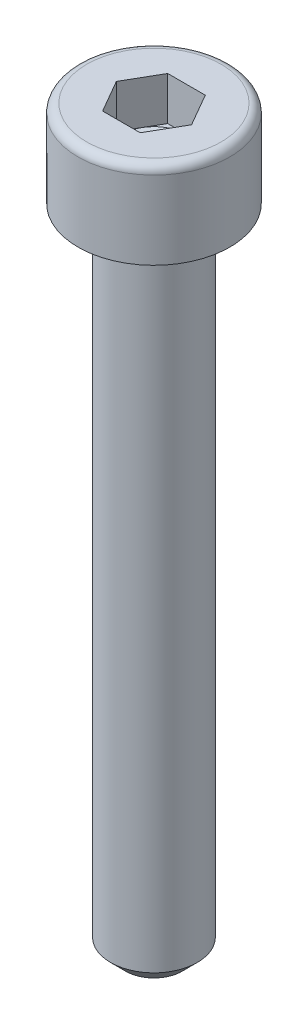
ISO-10303-21;
HEADER;
FILE_DESCRIPTION(('STEP AP214'),'2;1');
FILE_NAME('part.step','',(''),(''),'','','');
FILE_SCHEMA(('AUTOMOTIVE_DESIGN { 1 0 10303 214 1 1 1 1 }'));
ENDSEC;
DATA;
#1=APPLICATION_CONTEXT('core data for automotive mechanical design processes');
#2=APPLICATION_PROTOCOL_DEFINITION('international standard','automotive_design',2000,#1);
#3=PRODUCT_CONTEXT('',#1,'mechanical');
#4=PRODUCT('Part','Part','',(#3));
#5=PRODUCT_RELATED_PRODUCT_CATEGORY('part','',(#4));
#6=PRODUCT_DEFINITION_FORMATION('','',#4);
#7=PRODUCT_DEFINITION_CONTEXT('part definition',#1,'design');
#8=PRODUCT_DEFINITION('design','',#6,#7);
#9=PRODUCT_DEFINITION_SHAPE('','',#8);
#10=(LENGTH_UNIT() NAMED_UNIT(*) SI_UNIT(.MILLI.,.METRE.));
#11=(NAMED_UNIT(*) PLANE_ANGLE_UNIT() SI_UNIT($,.RADIAN.));
#12=(NAMED_UNIT(*) SI_UNIT($,.STERADIAN.) SOLID_ANGLE_UNIT());
#13=UNCERTAINTY_MEASURE_WITH_UNIT(LENGTH_MEASURE(1.E-05),#10,'distance_accuracy_value','');
#14=(GEOMETRIC_REPRESENTATION_CONTEXT(3) GLOBAL_UNCERTAINTY_ASSIGNED_CONTEXT((#13)) GLOBAL_UNIT_ASSIGNED_CONTEXT((#10,
#11,#12)) REPRESENTATION_CONTEXT('',''));
#15=CARTESIAN_POINT('',(0.,0.,0.));
#16=DIRECTION('',(0.,0.,1.));
#17=DIRECTION('',(1.,0.,0.));
#18=AXIS2_PLACEMENT_3D('',#15,#16,#17);
#19=CARTESIAN_POINT('',(1.5,4.,0.));
#20=DIRECTION('',(0.,-1.,0.));
#21=DIRECTION('',(1.,0.,0.));
#22=AXIS2_PLACEMENT_3D('',#19,#20,#21);
#23=PLANE('',#22);
#24=CARTESIAN_POINT('',(0.,4.,0.));
#25=DIRECTION('',(0.,1.,0.));
#26=DIRECTION('',(-1.,0.,0.));
#27=AXIS2_PLACEMENT_3D('',#24,#25,#26);
#28=CIRCLE('',#27,3.1);
#29=CARTESIAN_POINT('',(-3.1,4.,0.));
#30=VERTEX_POINT('',#29);
#31=EDGE_CURVE('E140',#30,#30,#28,.T.);
#32=ORIENTED_EDGE('',*,*,#31,.T.);
#33=EDGE_LOOP('',(#32));
#34=FACE_BOUND('',#33,.T.);
#35=DIRECTION('',(0.499999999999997,0.,0.86602540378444));
#36=VECTOR('',#35,1.);
#37=CARTESIAN_POINT('',(0.866025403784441,4.,-1.5));
#38=LINE('',#37,#36);
#39=CARTESIAN_POINT('',(0.866025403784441,4.,-1.5));
#40=VERTEX_POINT('',#39);
#41=CARTESIAN_POINT('',(1.73205080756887,4.,0.));
#42=VERTEX_POINT('',#41);
#43=EDGE_CURVE('E372',#40,#42,#38,.T.);
#44=ORIENTED_EDGE('',*,*,#43,.T.);
#45=DIRECTION('',(-0.499999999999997,0.,0.86602540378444));
#46=VECTOR('',#45,1.);
#47=CARTESIAN_POINT('',(0.866025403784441,4.,1.5));
#48=LINE('',#47,#46);
#49=CARTESIAN_POINT('',(0.866025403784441,4.,1.5));
#50=VERTEX_POINT('',#49);
#51=EDGE_CURVE('E375',#42,#50,#48,.T.);
#52=ORIENTED_EDGE('',*,*,#51,.T.);
#53=DIRECTION('',(-1.,0.,0.));
#54=VECTOR('',#53,1.);
#55=CARTESIAN_POINT('',(0.866025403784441,4.,1.5));
#56=LINE('',#55,#54);
#57=CARTESIAN_POINT('',(-0.866025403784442,4.,1.5));
#58=VERTEX_POINT('',#57);
#59=EDGE_CURVE('E378',#50,#58,#56,.T.);
#60=ORIENTED_EDGE('',*,*,#59,.T.);
#61=DIRECTION('',(-0.499999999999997,0.,-0.86602540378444));
#62=VECTOR('',#61,1.);
#63=CARTESIAN_POINT('',(-0.866025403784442,4.,1.5));
#64=LINE('',#63,#62);
#65=CARTESIAN_POINT('',(-1.73205080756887,4.,0.));
#66=VERTEX_POINT('',#65);
#67=EDGE_CURVE('E117',#58,#66,#64,.T.);
#68=ORIENTED_EDGE('',*,*,#67,.T.);
#69=DIRECTION('',(0.499999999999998,0.,-0.86602540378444));
#70=VECTOR('',#69,1.);
#71=CARTESIAN_POINT('',(-0.866025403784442,4.,-1.5));
#72=LINE('',#71,#70);
#73=CARTESIAN_POINT('',(-0.866025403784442,4.,-1.5));
#74=VERTEX_POINT('',#73);
#75=EDGE_CURVE('E369',#66,#74,#72,.T.);
#76=ORIENTED_EDGE('',*,*,#75,.T.);
#77=DIRECTION('',(1.,0.,0.));
#78=VECTOR('',#77,1.);
#79=CARTESIAN_POINT('',(0.866025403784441,4.,-1.5));
#80=LINE('',#79,#78);
#81=EDGE_CURVE('E128',#74,#40,#80,.T.);
#82=ORIENTED_EDGE('',*,*,#81,.T.);
#83=EDGE_LOOP('',(#44,#52,#60,#68,#76,#82));
#84=FACE_BOUND('',#83,.T.);
#85=ADVANCED_FACE('F34',(#34,#84),#23,.F.);
#86=CARTESIAN_POINT('',(0.,-30.,0.));
#87=DIRECTION('',(0.,1.,0.));
#88=DIRECTION('',(0.,0.,1.));
#89=AXIS2_PLACEMENT_3D('',#86,#87,#88);
#90=CYLINDRICAL_SURFACE('',#89,2.);
#91=CARTESIAN_POINT('',(0.,-29.3,0.));
#92=DIRECTION('',(0.,1.,0.));
#93=DIRECTION('',(0.,0.,1.));
#94=AXIS2_PLACEMENT_3D('',#91,#92,#93);
#95=CIRCLE('',#94,2.);
#96=CARTESIAN_POINT('',(0.,-29.3,2.));
#97=VERTEX_POINT('',#96);
#98=EDGE_CURVE('E42',#97,#97,#95,.T.);
#99=ORIENTED_EDGE('',*,*,#98,.T.);
#100=EDGE_LOOP('',(#99));
#101=FACE_BOUND('',#100,.T.);
#102=CARTESIAN_POINT('',(0.,0.,0.));
#103=DIRECTION('',(0.,1.,0.));
#104=DIRECTION('',(0.,0.,1.));
#105=AXIS2_PLACEMENT_3D('',#102,#103,#104);
#106=CIRCLE('',#105,2.);
#107=CARTESIAN_POINT('',(0.,0.,2.));
#108=VERTEX_POINT('',#107);
#109=EDGE_CURVE('E150',#108,#108,#106,.T.);
#110=ORIENTED_EDGE('',*,*,#109,.F.);
#111=EDGE_LOOP('',(#110));
#112=FACE_BOUND('',#111,.T.);
#113=ADVANCED_FACE('F155',(#101,#112),#90,.T.);
#114=CARTESIAN_POINT('',(0.,-30.,0.));
#115=DIRECTION('',(0.,1.,0.));
#116=DIRECTION('',(0.,0.,1.));
#117=AXIS2_PLACEMENT_3D('',#114,#115,#116);
#118=PLANE('',#117);
#119=CARTESIAN_POINT('',(0.,-30.,0.));
#120=DIRECTION('',(0.,1.,0.));
#121=DIRECTION('',(0.,0.,1.));
#122=AXIS2_PLACEMENT_3D('',#119,#120,#121);
#123=CIRCLE('',#122,1.3);
#124=CARTESIAN_POINT('',(0.,-30.,1.29999999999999));
#125=VERTEX_POINT('',#124);
#126=EDGE_CURVE('E11',#125,#125,#123,.F.);
#127=ORIENTED_EDGE('',*,*,#126,.T.);
#128=EDGE_LOOP('',(#127));
#129=FACE_BOUND('',#128,.T.);
#130=ADVANCED_FACE('F160',(#129),#118,.F.);
#131=CARTESIAN_POINT('',(0.,-29.3,0.));
#132=DIRECTION('',(0.,1.,0.));
#133=DIRECTION('',(0.,0.,1.));
#134=AXIS2_PLACEMENT_3D('',#131,#132,#133);
#135=CONICAL_SURFACE('',#134,2.,0.785398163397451);
#136=CARTESIAN_POINT('',(0.,-30.,1.29999999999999));
#137=CARTESIAN_POINT('',(0.,-29.9927083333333,1.30729166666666));
#138=CARTESIAN_POINT('',(0.,-29.9854166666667,1.31458333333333));
#139=CARTESIAN_POINT('',(0.,-29.9708333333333,1.32916666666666));
#140=CARTESIAN_POINT('',(0.,-29.9635416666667,1.33645833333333));
#141=CARTESIAN_POINT('',(0.,-29.9489583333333,1.35104166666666));
#142=CARTESIAN_POINT('',(0.,-29.9416666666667,1.35833333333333));
#143=CARTESIAN_POINT('',(0.,-29.9270833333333,1.37291666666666));
#144=CARTESIAN_POINT('',(0.,-29.9197916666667,1.38020833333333));
#145=CARTESIAN_POINT('',(0.,-29.9052083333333,1.39479166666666));
#146=CARTESIAN_POINT('',(0.,-29.8979166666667,1.40208333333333));
#147=CARTESIAN_POINT('',(0.,-29.8833333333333,1.41666666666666));
#148=CARTESIAN_POINT('',(0.,-29.8760416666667,1.42395833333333));
#149=CARTESIAN_POINT('',(0.,-29.8614583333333,1.43854166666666));
#150=CARTESIAN_POINT('',(0.,-29.8541666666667,1.44583333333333));
#151=CARTESIAN_POINT('',(0.,-29.8395833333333,1.46041666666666));
#152=CARTESIAN_POINT('',(0.,-29.8322916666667,1.46770833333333));
#153=CARTESIAN_POINT('',(0.,-29.8177083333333,1.48229166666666));
#154=CARTESIAN_POINT('',(0.,-29.8104166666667,1.48958333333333));
#155=CARTESIAN_POINT('',(0.,-29.7958333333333,1.50416666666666));
#156=CARTESIAN_POINT('',(0.,-29.7885416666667,1.51145833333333));
#157=CARTESIAN_POINT('',(0.,-29.7739583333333,1.52604166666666));
#158=CARTESIAN_POINT('',(0.,-29.7666666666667,1.53333333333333));
#159=CARTESIAN_POINT('',(0.,-29.7520833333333,1.54791666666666));
#160=CARTESIAN_POINT('',(0.,-29.7447916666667,1.55520833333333));
#161=CARTESIAN_POINT('',(0.,-29.7302083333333,1.56979166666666));
#162=CARTESIAN_POINT('',(0.,-29.7229166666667,1.57708333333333));
#163=CARTESIAN_POINT('',(0.,-29.7083333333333,1.59166666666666));
#164=CARTESIAN_POINT('',(0.,-29.7010416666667,1.59895833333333));
#165=CARTESIAN_POINT('',(0.,-29.6864583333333,1.61354166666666));
#166=CARTESIAN_POINT('',(0.,-29.6791666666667,1.62083333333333));
#167=CARTESIAN_POINT('',(0.,-29.6645833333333,1.63541666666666));
#168=CARTESIAN_POINT('',(0.,-29.6572916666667,1.64270833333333));
#169=CARTESIAN_POINT('',(0.,-29.6427083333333,1.65729166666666));
#170=CARTESIAN_POINT('',(0.,-29.6354166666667,1.66458333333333));
#171=CARTESIAN_POINT('',(0.,-29.6208333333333,1.67916666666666));
#172=CARTESIAN_POINT('',(0.,-29.6135416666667,1.68645833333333));
#173=CARTESIAN_POINT('',(0.,-29.5989583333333,1.70104166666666));
#174=CARTESIAN_POINT('',(0.,-29.5916666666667,1.70833333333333));
#175=CARTESIAN_POINT('',(0.,-29.5770833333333,1.72291666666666));
#176=CARTESIAN_POINT('',(0.,-29.5697916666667,1.73020833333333));
#177=CARTESIAN_POINT('',(0.,-29.5552083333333,1.74479166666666));
#178=CARTESIAN_POINT('',(0.,-29.5479166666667,1.75208333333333));
#179=CARTESIAN_POINT('',(0.,-29.5333333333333,1.76666666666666));
#180=CARTESIAN_POINT('',(0.,-29.5260416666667,1.77395833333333));
#181=CARTESIAN_POINT('',(0.,-29.5114583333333,1.78854166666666));
#182=CARTESIAN_POINT('',(0.,-29.5041666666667,1.79583333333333));
#183=CARTESIAN_POINT('',(0.,-29.4895833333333,1.81041666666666));
#184=CARTESIAN_POINT('',(0.,-29.4822916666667,1.81770833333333));
#185=CARTESIAN_POINT('',(0.,-29.4677083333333,1.83229166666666));
#186=CARTESIAN_POINT('',(0.,-29.4604166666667,1.83958333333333));
#187=CARTESIAN_POINT('',(0.,-29.4458333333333,1.85416666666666));
#188=CARTESIAN_POINT('',(0.,-29.4385416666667,1.86145833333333));
#189=CARTESIAN_POINT('',(0.,-29.4239583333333,1.87604166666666));
#190=CARTESIAN_POINT('',(0.,-29.4166666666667,1.88333333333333));
#191=CARTESIAN_POINT('',(0.,-29.4020833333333,1.89791666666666));
#192=CARTESIAN_POINT('',(0.,-29.3947916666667,1.90520833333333));
#193=CARTESIAN_POINT('',(0.,-29.3802083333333,1.91979166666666));
#194=CARTESIAN_POINT('',(0.,-29.3729166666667,1.92708333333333));
#195=CARTESIAN_POINT('',(0.,-29.3583333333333,1.94166666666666));
#196=CARTESIAN_POINT('',(0.,-29.3510416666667,1.94895833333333));
#197=CARTESIAN_POINT('',(0.,-29.3364583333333,1.96354166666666));
#198=CARTESIAN_POINT('',(0.,-29.3291666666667,1.97083333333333));
#199=CARTESIAN_POINT('',(0.,-29.3145833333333,1.98541666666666));
#200=CARTESIAN_POINT('',(0.,-29.3072916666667,1.99270833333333));
#201=CARTESIAN_POINT('',(0.,-29.3,2.));
#202=B_SPLINE_CURVE_WITH_KNOTS('',3,(#136,#137,#138,#139,#140,#141,#142,#143,#144,#145,#146,
#147,#148,#149,#150,#151,#152,#153,#154,#155,#156,#157,#158,#159,#160,#161,#162,#163,#164,#165,
#166,#167,#168,#169,#170,#171,#172,#173,#174,#175,#176,#177,#178,#179,#180,#181,#182,#183,#184,
#185,#186,#187,#188,#189,#190,#191,#192,#193,#194,#195,#196,#197,#198,#199,#200,#201),
.UNSPECIFIED.,.F.,.F.,(4,2,2,2,2,2,2,2,2,2,2,2,2,2,2,2,2,2,2,2,2,2,2,2,2,2,2,2,2,2,2,2,4),(0.,
0.0309359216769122,0.0618718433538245,0.0928077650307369,0.123743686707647,0.154679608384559,
0.185615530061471,0.216551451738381,0.247487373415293,0.278423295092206,0.309359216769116,
0.340295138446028,0.37123106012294,0.40216698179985,0.433102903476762,0.464038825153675,
0.494974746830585,0.525910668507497,0.556846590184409,0.587782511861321,0.618718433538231,
0.649654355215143,0.680590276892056,0.711526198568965,0.742462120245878,0.77339804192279,
0.8043339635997,0.835269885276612,0.866205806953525,0.897141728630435,0.928077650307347,
0.959013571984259,0.989949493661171),.UNSPECIFIED.);
#203=EDGE_CURVE('BSEAM36',#125,#97,#202,.T.);
#204=ORIENTED_EDGE('',*,*,#126,.F.);
#205=ORIENTED_EDGE('',*,*,#98,.F.);
#206=ORIENTED_EDGE('',*,*,#203,.T.);
#207=ORIENTED_EDGE('',*,*,#203,.F.);
#208=EDGE_LOOP('',(#204,#206,#205,#207));
#209=FACE_BOUND('',#208,.T.);
#210=ADVANCED_FACE('F36',(#209),#135,.T.);
#211=CARTESIAN_POINT('',(0.,0.,0.));
#212=DIRECTION('',(0.,1.,0.));
#213=DIRECTION('',(-1.,0.,0.));
#214=AXIS2_PLACEMENT_3D('',#211,#212,#213);
#215=PLANE('',#214);
#216=ORIENTED_EDGE('',*,*,#109,.T.);
#217=EDGE_LOOP('',(#216));
#218=FACE_BOUND('',#217,.T.);
#219=CARTESIAN_POINT('',(0.,0.,0.));
#220=DIRECTION('',(0.,1.,0.));
#221=DIRECTION('',(-1.,0.,0.));
#222=AXIS2_PLACEMENT_3D('',#219,#220,#221);
#223=CIRCLE('',#222,3.5);
#224=CARTESIAN_POINT('',(-3.5,0.,0.));
#225=VERTEX_POINT('',#224);
#226=EDGE_CURVE('E147',#225,#225,#223,.T.);
#227=ORIENTED_EDGE('',*,*,#226,.F.);
#228=EDGE_LOOP('',(#227));
#229=FACE_BOUND('',#228,.T.);
#230=ADVANCED_FACE('F159',(#218,#229),#215,.F.);
#231=CARTESIAN_POINT('',(0.,4.,0.));
#232=DIRECTION('',(0.,1.,0.));
#233=DIRECTION('',(-1.,0.,0.));
#234=AXIS2_PLACEMENT_3D('',#231,#232,#233);
#235=CYLINDRICAL_SURFACE('',#234,3.5);
#236=CARTESIAN_POINT('',(0.,3.6,0.));
#237=DIRECTION('',(0.,1.,0.));
#238=DIRECTION('',(-1.,0.,0.));
#239=AXIS2_PLACEMENT_3D('',#236,#237,#238);
#240=CIRCLE('',#239,3.5);
#241=CARTESIAN_POINT('',(-3.5,3.6,0.));
#242=VERTEX_POINT('',#241);
#243=EDGE_CURVE('E144',#242,#242,#240,.T.);
#244=ORIENTED_EDGE('',*,*,#243,.F.);
#245=EDGE_LOOP('',(#244));
#246=FACE_BOUND('',#245,.T.);
#247=ORIENTED_EDGE('',*,*,#226,.T.);
#248=EDGE_LOOP('',(#247));
#249=FACE_BOUND('',#248,.T.);
#250=ADVANCED_FACE('F166',(#246,#249),#235,.T.);
#251=CARTESIAN_POINT('',(0.,3.6,0.));
#252=DIRECTION('',(0.,1.,0.));
#253=DIRECTION('',(-1.,0.,0.));
#254=AXIS2_PLACEMENT_3D('',#251,#252,#253);
#255=TOROIDAL_SURFACE('',#254,3.1,0.4);
#256=ORIENTED_EDGE('',*,*,#31,.F.);
#257=EDGE_LOOP('',(#256));
#258=FACE_BOUND('',#257,.T.);
#259=ORIENTED_EDGE('',*,*,#243,.T.);
#260=EDGE_LOOP('',(#259));
#261=FACE_BOUND('',#260,.T.);
#262=ADVANCED_FACE('F183',(#258,#261),#255,.T.);
#263=CARTESIAN_POINT('',(-0.866025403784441,2.,-1.5));
#264=DIRECTION('',(0.86602540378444,0.,0.499999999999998));
#265=DIRECTION('',(0.499999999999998,0.,-0.86602540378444));
#266=AXIS2_PLACEMENT_3D('',#263,#264,#265);
#267=PLANE('',#266);
#268=ORIENTED_EDGE('',*,*,#75,.F.);
#269=DIRECTION('',(0.,1.,0.));
#270=VECTOR('',#269,1.);
#271=CARTESIAN_POINT('',(-1.73205080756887,2.,0.));
#272=LINE('',#271,#270);
#273=CARTESIAN_POINT('',(-1.73205080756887,2.,0.));
#274=VERTEX_POINT('',#273);
#275=EDGE_CURVE('E364',#274,#66,#272,.T.);
#276=ORIENTED_EDGE('',*,*,#275,.F.);
#277=DIRECTION('',(0.499999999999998,0.,-0.86602540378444));
#278=VECTOR('',#277,1.);
#279=CARTESIAN_POINT('',(-0.866025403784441,2.,-1.5));
#280=LINE('',#279,#278);
#281=CARTESIAN_POINT('',(-1.29903810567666,2.,-0.749999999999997));
#282=VERTEX_POINT('',#281);
#283=EDGE_CURVE('E113',#274,#282,#280,.T.);
#284=ORIENTED_EDGE('',*,*,#283,.T.);
#285=CARTESIAN_POINT('',(-0.866025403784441,2.,-1.5));
#286=VERTEX_POINT('',#285);
#287=EDGE_CURVE('E107',#282,#286,#280,.T.);
#288=ORIENTED_EDGE('',*,*,#287,.T.);
#289=DIRECTION('',(0.,1.,0.));
#290=VECTOR('',#289,1.);
#291=CARTESIAN_POINT('',(-0.866025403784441,2.,-1.5));
#292=LINE('',#291,#290);
#293=EDGE_CURVE('E109',#286,#74,#292,.T.);
#294=ORIENTED_EDGE('',*,*,#293,.T.);
#295=EDGE_LOOP('',(#268,#276,#284,#288,#294));
#296=FACE_BOUND('',#295,.T.);
#297=ADVANCED_FACE('F108',(#296),#267,.T.);
#298=CARTESIAN_POINT('',(0.866025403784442,2.,-1.5));
#299=DIRECTION('',(0.,0.,1.));
#300=DIRECTION('',(1.,0.,0.));
#301=AXIS2_PLACEMENT_3D('',#298,#299,#300);
#302=PLANE('',#301);
#303=ORIENTED_EDGE('',*,*,#81,.F.);
#304=ORIENTED_EDGE('',*,*,#293,.F.);
#305=DIRECTION('',(1.,0.,0.));
#306=VECTOR('',#305,1.);
#307=CARTESIAN_POINT('',(0.866025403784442,2.,-1.5));
#308=LINE('',#307,#306);
#309=CARTESIAN_POINT('',(0.,2.,-1.5));
#310=VERTEX_POINT('',#309);
#311=EDGE_CURVE('E49',#286,#310,#308,.T.);
#312=ORIENTED_EDGE('',*,*,#311,.T.);
#313=CARTESIAN_POINT('',(0.866025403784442,2.,-1.5));
#314=VERTEX_POINT('',#313);
#315=EDGE_CURVE('E123',#310,#314,#308,.T.);
#316=ORIENTED_EDGE('',*,*,#315,.T.);
#317=DIRECTION('',(0.,1.,0.));
#318=VECTOR('',#317,1.);
#319=CARTESIAN_POINT('',(0.866025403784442,2.,-1.5));
#320=LINE('',#319,#318);
#321=EDGE_CURVE('E130',#314,#40,#320,.T.);
#322=ORIENTED_EDGE('',*,*,#321,.T.);
#323=EDGE_LOOP('',(#303,#304,#312,#316,#322));
#324=FACE_BOUND('',#323,.T.);
#325=ADVANCED_FACE('F125',(#324),#302,.T.);
#326=CARTESIAN_POINT('',(0.866025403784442,2.,-1.5));
#327=DIRECTION('',(-0.86602540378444,0.,0.499999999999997));
#328=DIRECTION('',(0.499999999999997,0.,0.86602540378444));
#329=AXIS2_PLACEMENT_3D('',#326,#327,#328);
#330=PLANE('',#329);
#331=ORIENTED_EDGE('',*,*,#43,.F.);
#332=ORIENTED_EDGE('',*,*,#321,.F.);
#333=DIRECTION('',(0.499999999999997,0.,0.86602540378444));
#334=VECTOR('',#333,1.);
#335=CARTESIAN_POINT('',(0.866025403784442,2.,-1.5));
#336=LINE('',#335,#334);
#337=CARTESIAN_POINT('',(1.29903810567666,2.,-0.749999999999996));
#338=VERTEX_POINT('',#337);
#339=EDGE_CURVE('E397',#314,#338,#336,.T.);
#340=ORIENTED_EDGE('',*,*,#339,.T.);
#341=CARTESIAN_POINT('',(1.73205080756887,2.,0.));
#342=VERTEX_POINT('',#341);
#343=EDGE_CURVE('E122',#338,#342,#336,.T.);
#344=ORIENTED_EDGE('',*,*,#343,.T.);
#345=DIRECTION('',(0.,1.,0.));
#346=VECTOR('',#345,1.);
#347=CARTESIAN_POINT('',(1.73205080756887,2.,0.));
#348=LINE('',#347,#346);
#349=EDGE_CURVE('E135',#342,#42,#348,.T.);
#350=ORIENTED_EDGE('',*,*,#349,.T.);
#351=EDGE_LOOP('',(#331,#332,#340,#344,#350));
#352=FACE_BOUND('',#351,.T.);
#353=ADVANCED_FACE('F213',(#352),#330,.T.);
#354=CARTESIAN_POINT('',(0.866025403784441,2.,1.5));
#355=DIRECTION('',(-0.86602540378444,0.,-0.499999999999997));
#356=DIRECTION('',(-0.499999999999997,0.,0.86602540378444));
#357=AXIS2_PLACEMENT_3D('',#354,#355,#356);
#358=PLANE('',#357);
#359=ORIENTED_EDGE('',*,*,#51,.F.);
#360=ORIENTED_EDGE('',*,*,#349,.F.);
#361=DIRECTION('',(-0.499999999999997,0.,0.86602540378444));
#362=VECTOR('',#361,1.);
#363=CARTESIAN_POINT('',(0.866025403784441,2.,1.5));
#364=LINE('',#363,#362);
#365=CARTESIAN_POINT('',(1.29903810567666,2.,0.749999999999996));
#366=VERTEX_POINT('',#365);
#367=EDGE_CURVE('E395',#342,#366,#364,.T.);
#368=ORIENTED_EDGE('',*,*,#367,.T.);
#369=CARTESIAN_POINT('',(0.866025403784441,2.,1.5));
#370=VERTEX_POINT('',#369);
#371=EDGE_CURVE('E396',#366,#370,#364,.T.);
#372=ORIENTED_EDGE('',*,*,#371,.T.);
#373=DIRECTION('',(0.,1.,0.));
#374=VECTOR('',#373,1.);
#375=CARTESIAN_POINT('',(0.866025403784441,2.,1.5));
#376=LINE('',#375,#374);
#377=EDGE_CURVE('E384',#370,#50,#376,.T.);
#378=ORIENTED_EDGE('',*,*,#377,.T.);
#379=EDGE_LOOP('',(#359,#360,#368,#372,#378));
#380=FACE_BOUND('',#379,.T.);
#381=ADVANCED_FACE('F220',(#380),#358,.T.);
#382=CARTESIAN_POINT('',(0.866025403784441,2.,1.5));
#383=DIRECTION('',(0.,0.,-1.));
#384=DIRECTION('',(-1.,0.,0.));
#385=AXIS2_PLACEMENT_3D('',#382,#383,#384);
#386=PLANE('',#385);
#387=ORIENTED_EDGE('',*,*,#59,.F.);
#388=ORIENTED_EDGE('',*,*,#377,.F.);
#389=DIRECTION('',(-1.,0.,0.));
#390=VECTOR('',#389,1.);
#391=CARTESIAN_POINT('',(0.866025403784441,2.,1.5));
#392=LINE('',#391,#390);
#393=CARTESIAN_POINT('',(0.,2.,1.5));
#394=VERTEX_POINT('',#393);
#395=EDGE_CURVE('E359',#370,#394,#392,.T.);
#396=ORIENTED_EDGE('',*,*,#395,.T.);
#397=CARTESIAN_POINT('',(-0.866025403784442,2.,1.5));
#398=VERTEX_POINT('',#397);
#399=EDGE_CURVE('E355',#394,#398,#392,.T.);
#400=ORIENTED_EDGE('',*,*,#399,.T.);
#401=DIRECTION('',(0.,1.,0.));
#402=VECTOR('',#401,1.);
#403=CARTESIAN_POINT('',(-0.866025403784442,2.,1.5));
#404=LINE('',#403,#402);
#405=EDGE_CURVE('E363',#398,#58,#404,.T.);
#406=ORIENTED_EDGE('',*,*,#405,.T.);
#407=EDGE_LOOP('',(#387,#388,#396,#400,#406));
#408=FACE_BOUND('',#407,.T.);
#409=ADVANCED_FACE('F228',(#408),#386,.T.);
#410=CARTESIAN_POINT('',(-0.866025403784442,2.,1.5));
#411=DIRECTION('',(0.86602540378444,0.,-0.499999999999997));
#412=DIRECTION('',(-0.499999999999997,0.,-0.86602540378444));
#413=AXIS2_PLACEMENT_3D('',#410,#411,#412);
#414=PLANE('',#413);
#415=ORIENTED_EDGE('',*,*,#67,.F.);
#416=ORIENTED_EDGE('',*,*,#405,.F.);
#417=DIRECTION('',(-0.499999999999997,0.,-0.86602540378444));
#418=VECTOR('',#417,1.);
#419=CARTESIAN_POINT('',(-0.866025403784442,2.,1.5));
#420=LINE('',#419,#418);
#421=CARTESIAN_POINT('',(-1.29903810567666,2.,0.749999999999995));
#422=VERTEX_POINT('',#421);
#423=EDGE_CURVE('E354',#398,#422,#420,.T.);
#424=ORIENTED_EDGE('',*,*,#423,.T.);
#425=EDGE_CURVE('E357',#422,#274,#420,.T.);
#426=ORIENTED_EDGE('',*,*,#425,.T.);
#427=ORIENTED_EDGE('',*,*,#275,.T.);
#428=EDGE_LOOP('',(#415,#416,#424,#426,#427));
#429=FACE_BOUND('',#428,.T.);
#430=ADVANCED_FACE('F236',(#429),#414,.T.);
#431=CARTESIAN_POINT('',(-2.59807621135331,2.,1.5));
#432=DIRECTION('',(0.,-1.,0.));
#433=DIRECTION('',(0.,0.,-1.));
#434=AXIS2_PLACEMENT_3D('',#431,#432,#433);
#435=PLANE('',#434);
#436=ORIENTED_EDGE('',*,*,#311,.F.);
#437=ORIENTED_EDGE('',*,*,#287,.F.);
#438=CARTESIAN_POINT('',(0.,2.,0.));
#439=DIRECTION('',(0.,1.,0.));
#440=DIRECTION('',(-1.,0.,0.));
#441=AXIS2_PLACEMENT_3D('',#438,#439,#440);
#442=CIRCLE('',#441,1.5);
#443=EDGE_CURVE('E120',#310,#282,#442,.T.);
#444=ORIENTED_EDGE('',*,*,#443,.F.);
#445=EDGE_LOOP('',(#436,#437,#444));
#446=FACE_BOUND('',#445,.T.);
#447=ADVANCED_FACE('F119',(#446),#435,.F.);
#448=ORIENTED_EDGE('',*,*,#283,.F.);
#449=ORIENTED_EDGE('',*,*,#425,.F.);
#450=EDGE_CURVE('E129',#282,#422,#442,.T.);
#451=ORIENTED_EDGE('',*,*,#450,.F.);
#452=EDGE_LOOP('',(#448,#449,#451));
#453=FACE_BOUND('',#452,.T.);
#454=ADVANCED_FACE('F251',(#453),#435,.F.);
#455=ORIENTED_EDGE('',*,*,#423,.F.);
#456=ORIENTED_EDGE('',*,*,#399,.F.);
#457=EDGE_CURVE('E134',#422,#394,#442,.T.);
#458=ORIENTED_EDGE('',*,*,#457,.F.);
#459=EDGE_LOOP('',(#455,#456,#458));
#460=FACE_BOUND('',#459,.T.);
#461=ADVANCED_FACE('F259',(#460),#435,.F.);
#462=ORIENTED_EDGE('',*,*,#395,.F.);
#463=ORIENTED_EDGE('',*,*,#371,.F.);
#464=EDGE_CURVE('E141',#394,#366,#442,.T.);
#465=ORIENTED_EDGE('',*,*,#464,.F.);
#466=EDGE_LOOP('',(#462,#463,#465));
#467=FACE_BOUND('',#466,.T.);
#468=ADVANCED_FACE('F266',(#467),#435,.F.);
#469=ORIENTED_EDGE('',*,*,#367,.F.);
#470=ORIENTED_EDGE('',*,*,#343,.F.);
#471=EDGE_CURVE('E401',#366,#338,#442,.T.);
#472=ORIENTED_EDGE('',*,*,#471,.F.);
#473=EDGE_LOOP('',(#469,#470,#472));
#474=FACE_BOUND('',#473,.T.);
#475=ADVANCED_FACE('F273',(#474),#435,.F.);
#476=ORIENTED_EDGE('',*,*,#339,.F.);
#477=ORIENTED_EDGE('',*,*,#315,.F.);
#478=EDGE_CURVE('E400',#338,#310,#442,.T.);
#479=ORIENTED_EDGE('',*,*,#478,.F.);
#480=EDGE_LOOP('',(#476,#477,#479));
#481=FACE_BOUND('',#480,.T.);
#482=ADVANCED_FACE('F253',(#481),#435,.F.);
#483=CARTESIAN_POINT('',(0.,2.,0.));
#484=DIRECTION('',(0.,1.,0.));
#485=DIRECTION('',(-1.,0.,0.));
#486=AXIS2_PLACEMENT_3D('',#483,#484,#485);
#487=CONICAL_SURFACE('',#486,1.5,1.04719755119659);
#488=CARTESIAN_POINT('',(0.,1.13397459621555,0.));
#489=VERTEX_POINT('',#488);
#490=VERTEX_LOOP('',#489);
#491=FACE_BOUND('',#490,.T.);
#492=ORIENTED_EDGE('',*,*,#457,.T.);
#493=ORIENTED_EDGE('',*,*,#464,.T.);
#494=ORIENTED_EDGE('',*,*,#471,.T.);
#495=ORIENTED_EDGE('',*,*,#478,.T.);
#496=ORIENTED_EDGE('',*,*,#443,.T.);
#497=ORIENTED_EDGE('',*,*,#450,.T.);
#498=EDGE_LOOP('',(#492,#493,#494,#495,#496,#497));
#499=FACE_BOUND('',#498,.T.);
#500=ADVANCED_FACE('F181',(#491,#499),#487,.F.);
#501=CLOSED_SHELL('',(#85,#113,#130,#210,#230,#250,#262,#297,#325,#353,#381,#409,#430,#447,#454,
#461,#468,#475,#482,#500));
#502=MANIFOLD_SOLID_BREP('B2',#501);
#503=ADVANCED_BREP_SHAPE_REPRESENTATION('',(#18,#502),#14);
#504=SHAPE_DEFINITION_REPRESENTATION(#9,#503);
ENDSEC;
END-ISO-10303-21;
